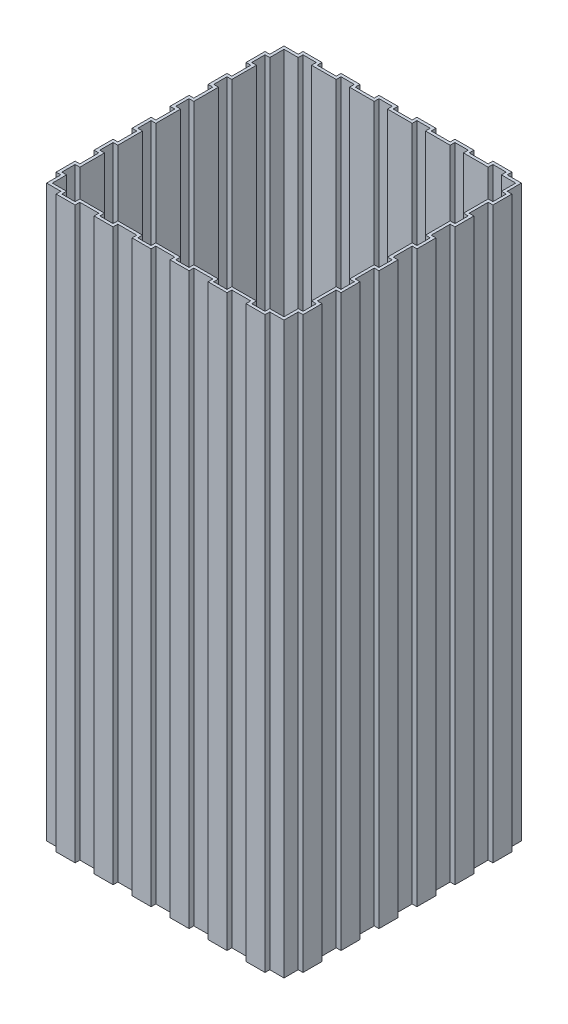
from build123d import *

# Parameters (mm, degrees)
SKETCH1_W                = 50
SKETCH1_H                = 50
BOSS_EXTRUDE1_DEPTH      = 120
SKETCH2_W                = 1
SKETCH2_H                = 4
SKETCH2_W_2              = 4
SKETCH2_H_2              = 1
BOSS_EXTRUDE2_DEPTH      = 120
SHELL3_T                 = -0.6
SHELL3_THICKNESS_2_DEPTH = 0.9


with BuildPart() as part:
    # Sketch1 → Boss-Extrude1 (new body)
    with BuildSketch(Plane(origin=(0, 0, 0), x_dir=(1, 0, 0), z_dir=(0, 1, 0))):
        Rectangle(SKETCH1_W, SKETCH1_H)
    extrude(amount=BOSS_EXTRUDE1_DEPTH)

    # Sketch2 → Boss-Extrude2 (add)
    with BuildSketch(Plane(origin=(0, 0, 0), x_dir=(1, 0, 0), z_dir=(0, 1, 0))):
        with Locations((25.5, -20)):
            Rectangle(SKETCH2_W, SKETCH2_H)
        with Locations((25.5, -12)):
            Rectangle(SKETCH2_W, SKETCH2_H)
        with Locations((25.5, -4)):
            Rectangle(SKETCH2_W, SKETCH2_H)
        with Locations((25.5, 4)):
            Rectangle(SKETCH2_W, SKETCH2_H)
        with Locations((25.5, 12)):
            Rectangle(SKETCH2_W, SKETCH2_H)
        with Locations((25.5, 20)):
            Rectangle(SKETCH2_W, SKETCH2_H)
        with Locations((-20, -25.5)):
            Rectangle(SKETCH2_W_2, SKETCH2_H_2)
        with Locations((-12, -25.5)):
            Rectangle(SKETCH2_W_2, SKETCH2_H_2)
        with Locations((-4, -25.5)):
            Rectangle(SKETCH2_W_2, SKETCH2_H_2)
        with Locations((4, -25.5)):
            Rectangle(SKETCH2_W_2, SKETCH2_H_2)
        with Locations((12, -25.5)):
            Rectangle(SKETCH2_W_2, SKETCH2_H_2)
        with Locations((20, -25.5)):
            Rectangle(SKETCH2_W_2, SKETCH2_H_2)
        with Locations((-25.5, 20)):
            Rectangle(SKETCH2_W, SKETCH2_H)
        with Locations((-25.5, 12)):
            Rectangle(SKETCH2_W, SKETCH2_H)
        with Locations((-25.5, 4)):
            Rectangle(SKETCH2_W, SKETCH2_H)
        with Locations((-25.5, -4)):
            Rectangle(SKETCH2_W, SKETCH2_H)
        with Locations((-25.5, -12)):
            Rectangle(SKETCH2_W, SKETCH2_H)
        with Locations((-25.5, -20)):
            Rectangle(SKETCH2_W, SKETCH2_H)
        with Locations((20, 25.5)):
            Rectangle(SKETCH2_W_2, SKETCH2_H_2)
        with Locations((12, 25.5)):
            Rectangle(SKETCH2_W_2, SKETCH2_H_2)
        with Locations((4, 25.5)):
            Rectangle(SKETCH2_W_2, SKETCH2_H_2)
        with Locations((-4, 25.5)):
            Rectangle(SKETCH2_W_2, SKETCH2_H_2)
        with Locations((-12, 25.5)):
            Rectangle(SKETCH2_W_2, SKETCH2_H_2)
        with Locations((-20, 25.5)):
            Rectangle(SKETCH2_W_2, SKETCH2_H_2)
    extrude(amount=BOSS_EXTRUDE2_DEPTH)

    # Shell3
    shell3_openings = [part.faces().sort_by_distance(p)[0] for p in [
        (0, 120, 0),
    ]]
    offset(amount=SHELL3_T, openings=shell3_openings, kind=Kind.INTERSECTION)

    # Shell3 thickness 2 face (on inner face of the shell) → Shell3 thickness 2 (add)
    with BuildSketch(Plane(origin=(0, 0.6, 0), x_dir=(0, 0, -1), z_dir=(0, -1, 0))):
        Polygon((-21.4, -24.4), (-24.4, -24.4), (-24.4, -21.4), (-25.4, -21.4), (-25.4, -18.6), (-24.4, -18.6), (-24.4, -13.4), (-25.4, -13.4), (-25.4, -10.6), (-24.4, -10.6), (-24.4, -5.4), (-25.4, -5.4), (-25.4, -2.6), (-24.4, -2.6), (-24.4, 2.6), (-25.4, 2.6), (-25.4, 5.4), (-24.4, 5.4), (-24.4, 10.6), (-25.4, 10.6), (-25.4, 13.4), (-24.4, 13.4), (-24.4, 18.6), (-25.4, 18.6), (-25.4, 21.4), (-24.4, 21.4), (-24.4, 24.4), (-21.4, 24.4), (-21.4, 25.4), (-18.6, 25.4), (-18.6, 24.4), (-13.4, 24.4), (-13.4, 25.4), (-10.6, 25.4), (-10.6, 24.4), (-5.4, 24.4), (-5.4, 25.4), (-2.6, 25.4), (-2.6, 24.4), (2.6, 24.4), (2.6, 25.4), (5.4, 25.4), (5.4, 24.4), (10.6, 24.4), (10.6, 25.4), (13.4, 25.4), (13.4, 24.4), (18.6, 24.4), (18.6, 25.4), (21.4, 25.4), (21.4, 24.4), (24.4, 24.4), (24.4, 21.4), (25.4, 21.4), (25.4, 18.6), (24.4, 18.6), (24.4, 13.4), (25.4, 13.4), (25.4, 10.6), (24.4, 10.6), (24.4, 5.4), (25.4, 5.4), (25.4, 2.6), (24.4, 2.6), (24.4, -2.6), (25.4, -2.6), (25.4, -5.4), (24.4, -5.4), (24.4, -10.6), (25.4, -10.6), (25.4, -13.4), (24.4, -13.4), (24.4, -18.6), (25.4, -18.6), (25.4, -21.4), (24.4, -21.4), (24.4, -24.4), (21.4, -24.4), (21.4, -25.4), (18.6, -25.4), (18.6, -24.4), (13.4, -24.4), (13.4, -25.4), (10.6, -25.4), (10.6, -24.4), (5.4, -24.4), (5.4, -25.4), (2.6, -25.4), (2.6, -24.4), (-2.6, -24.4), (-2.6, -25.4), (-5.4, -25.4), (-5.4, -24.4), (-10.6, -24.4), (-10.6, -25.4), (-13.4, -25.4), (-13.4, -24.4), (-18.6, -24.4), (-18.6, -25.4), (-21.4, -25.4), align=None)
    extrude(amount=-SHELL3_THICKNESS_2_DEPTH)


solid = part.part
